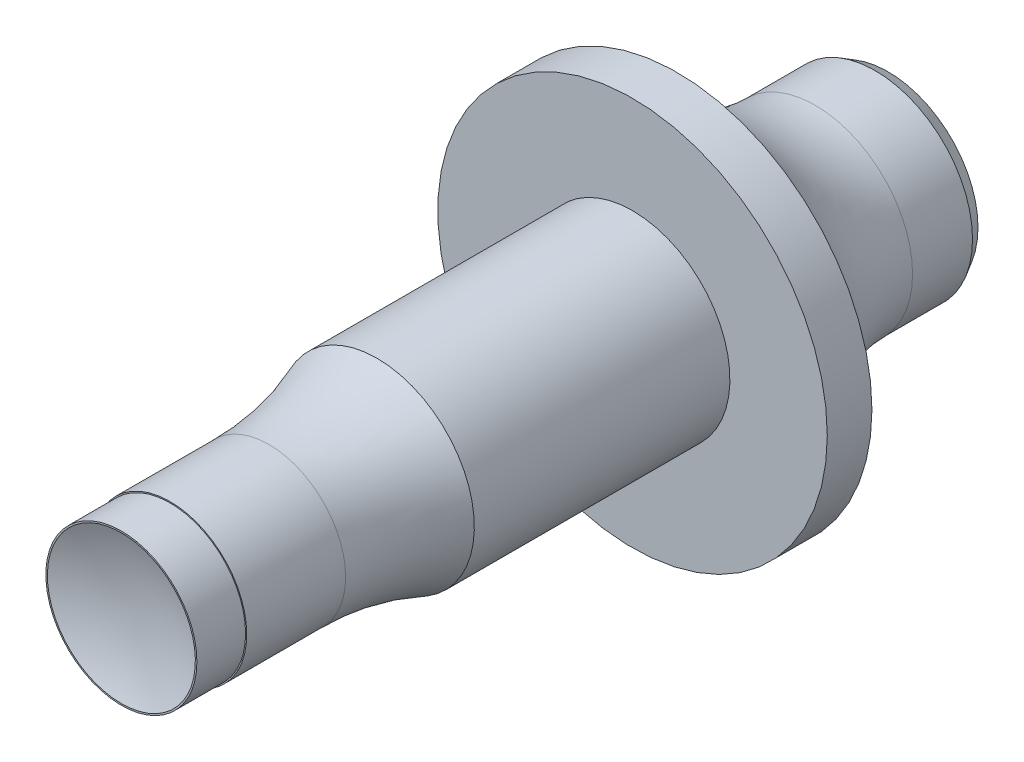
from build123d import *

# Parameters (mm, degrees)
SKETCH1_R           = 12.7
BOSS_EXTRUDE1_DEPTH = 100
SKETCH2_OUTSIDE_W   = 48.652
SKETCH2_OUTSIDE_H   = 48.652
SKETCH2_OUTSIDE_R   = 10
CUT_EXTRUDE1_DEPTH  = 33.333333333
SKETCH3_OUTSIDE_W   = 48.652
SKETCH3_OUTSIDE_H   = 48.652
SKETCH3_OUTSIDE_R   = 9.85
CUT_EXTRUDE2_DEPTH  = 6.35
CHAMFER1_SIZE       = 1.693333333
CHAMFER1_SIZE2      = 0.977646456


with BuildPart() as part:
    # Sketch1 → Boss-Extrude1 (new body)
    with BuildSketch(Plane.XY):
        Circle(SKETCH1_R)
    extrude(amount=-BOSS_EXTRUDE1_DEPTH)

    # Sketch2 outside → Cut-Extrude1 (cut)
    with BuildSketch(Plane.XY):
        Rectangle(SKETCH2_OUTSIDE_W, SKETCH2_OUTSIDE_H)
        Circle(SKETCH2_OUTSIDE_R, mode=Mode.SUBTRACT)
    extrude(amount=-CUT_EXTRUDE1_DEPTH, mode=Mode.SUBTRACT)

    # Sketch3 outside → Cut-Extrude2 (cut)
    with BuildSketch(Plane.XY):
        Rectangle(SKETCH3_OUTSIDE_W, SKETCH3_OUTSIDE_H)
        Circle(SKETCH3_OUTSIDE_R, mode=Mode.SUBTRACT)
    extrude(amount=-CUT_EXTRUDE2_DEPTH, mode=Mode.SUBTRACT)

    # Sketch4 → Cut-Revolve1 (revolve, cut)
    with BuildSketch(Plane(origin=(0, 0, 0), x_dir=(0, 0, -1), z_dir=(1, 0, 0)), mode=Mode.PRIVATE) as cut_revolve1_sk:
        with BuildLine():
            Line((0, 0), (0, 9.65))
            ThreePointArc((0, 9.65), (1.423843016, 4.918071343), (1.904521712, 0))
            Line((1.904521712, 0), (0, 0))
        make_face()
    revolve(cut_revolve1_sk.sketch.rotate(Axis((0, 0, 0), (0, 0, -1)), 180), axis=Axis((0, 0, 0), (0, 0, -1)), mode=Mode.SUBTRACT)

    # Chamfer1
    chamfer1_edges = [part.edges().sort_by_distance(p)[0] for p in [
        (-12.7, 0, -100),
    ]]
    chamfer1_side = [part.faces().sort_by_distance(p)[0] for p in [
        (-12.7, 0, -66.666666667),
    ]]
    chamfer(chamfer1_edges, length=CHAMFER1_SIZE, length2=CHAMFER1_SIZE2, reference=chamfer1_side[0])

    # Sketch5 → Revolve1 (revolve)
    with BuildSketch(Plane(origin=(0, 0, 0), x_dir=(0, 0, -1), z_dir=(1, 0, 0)), mode=Mode.PRIVATE) as revolve1_sk:
        with BuildLine():
            Line((33.333333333, 0), (19.246105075, 0))
            Line((19.246105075, 0), (19.246105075, 10))
            ThreePointArc((19.246105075, 10), (26.417924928, 10.681087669), (33.333333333, 12.7))
            Line((33.333333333, 12.7), (33.333333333, 0))
        make_face()
    revolve(revolve1_sk.sketch.rotate(Axis((0, 0, -33.333333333), (0, 0, 1)), 270), axis=Axis((0, 0, -33.333333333), (0, 0, 1)))

    # Sketch6 → Revolve2 (revolve)
    with BuildSketch(Plane(origin=(0, 0, 0), x_dir=(0, 0, -1), z_dir=(1, 0, 0)), mode=Mode.PRIVATE) as revolve2_sk:
        with BuildLine():
            Line((66.666666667, 0), (90.486666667, 0))
            Line((90.486666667, 0), (90.486666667, 12.7))
            ThreePointArc((90.486666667, 12.7), (79.47371974, 16.194712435), (72.490833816, 25.4))
            Line((72.490833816, 25.4), (66.666666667, 25.4))
            Line((66.666666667, 25.4), (66.666666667, 0))
        make_face()
    revolve(revolve2_sk.sketch.rotate(Axis((0, 0, -66.666666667), (0, 0, -1)), 90), axis=Axis((0, 0, -66.666666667), (0, 0, -1)))


solid = part.part
